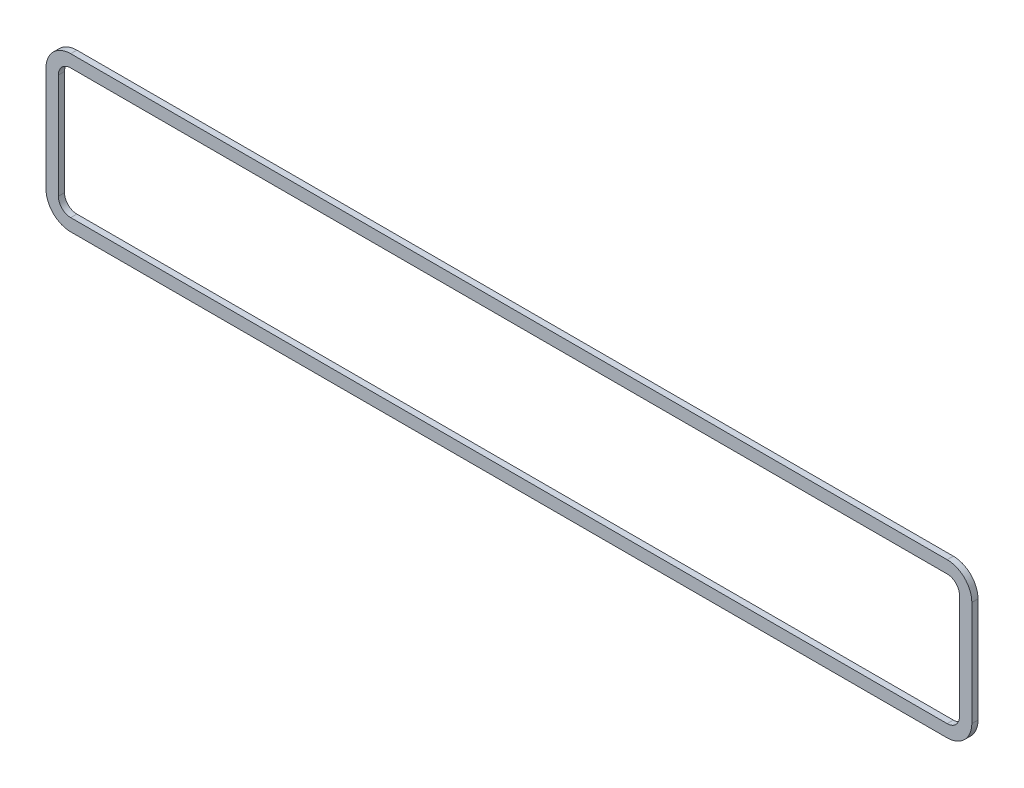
ISO-10303-21;
HEADER;
FILE_DESCRIPTION(('STEP AP214'),'2;1');
FILE_NAME('part.step','',(''),(''),'','','');
FILE_SCHEMA(('AUTOMOTIVE_DESIGN { 1 0 10303 214 1 1 1 1 }'));
ENDSEC;
DATA;
#1=APPLICATION_CONTEXT('core data for automotive mechanical design processes');
#2=APPLICATION_PROTOCOL_DEFINITION('international standard','automotive_design',2000,#1);
#3=PRODUCT_CONTEXT('',#1,'mechanical');
#4=PRODUCT('Part','Part','',(#3));
#5=PRODUCT_RELATED_PRODUCT_CATEGORY('part','',(#4));
#6=PRODUCT_DEFINITION_FORMATION('','',#4);
#7=PRODUCT_DEFINITION_CONTEXT('part definition',#1,'design');
#8=PRODUCT_DEFINITION('design','',#6,#7);
#9=PRODUCT_DEFINITION_SHAPE('','',#8);
#10=(LENGTH_UNIT() NAMED_UNIT(*) SI_UNIT(.MILLI.,.METRE.));
#11=(NAMED_UNIT(*) PLANE_ANGLE_UNIT() SI_UNIT($,.RADIAN.));
#12=(NAMED_UNIT(*) SI_UNIT($,.STERADIAN.) SOLID_ANGLE_UNIT());
#13=UNCERTAINTY_MEASURE_WITH_UNIT(LENGTH_MEASURE(1.E-05),#10,'distance_accuracy_value','');
#14=(GEOMETRIC_REPRESENTATION_CONTEXT(3) GLOBAL_UNCERTAINTY_ASSIGNED_CONTEXT((#13)) GLOBAL_UNIT_ASSIGNED_CONTEXT((#10,
#11,#12)) REPRESENTATION_CONTEXT('',''));
#15=CARTESIAN_POINT('',(0.,0.,0.));
#16=DIRECTION('',(0.,0.,1.));
#17=DIRECTION('',(1.,0.,0.));
#18=AXIS2_PLACEMENT_3D('',#15,#16,#17);
#19=CARTESIAN_POINT('',(35.5,-8.,-0.5));
#20=DIRECTION('',(0.,0.,1.));
#21=DIRECTION('',(1.,0.,0.));
#22=AXIS2_PLACEMENT_3D('',#19,#20,#21);
#23=CYLINDRICAL_SURFACE('',#22,2.);
#24=CARTESIAN_POINT('',(35.5,-8.,0.));
#25=DIRECTION('',(0.,0.,1.));
#26=DIRECTION('',(-1.,0.,0.));
#27=AXIS2_PLACEMENT_3D('',#24,#25,#26);
#28=CIRCLE('',#27,2.);
#29=CARTESIAN_POINT('',(35.5,-10.,0.));
#30=VERTEX_POINT('',#29);
#31=CARTESIAN_POINT('',(37.5,-8.,0.));
#32=VERTEX_POINT('',#31);
#33=EDGE_CURVE('E202',#30,#32,#28,.T.);
#34=ORIENTED_EDGE('',*,*,#33,.F.);
#35=DIRECTION('',(0.,0.,1.));
#36=VECTOR('',#35,1.);
#37=CARTESIAN_POINT('',(35.5,-10.,-0.5));
#38=LINE('',#37,#36);
#39=CARTESIAN_POINT('',(35.5,-10.,-0.5));
#40=VERTEX_POINT('',#39);
#41=EDGE_CURVE('E11',#40,#30,#38,.T.);
#42=ORIENTED_EDGE('',*,*,#41,.F.);
#43=CARTESIAN_POINT('',(35.5,-8.,-0.5));
#44=DIRECTION('',(0.,0.,1.));
#45=DIRECTION('',(-1.,0.,0.));
#46=AXIS2_PLACEMENT_3D('',#43,#44,#45);
#47=CIRCLE('',#46,2.);
#48=CARTESIAN_POINT('',(37.5,-8.,-0.5));
#49=VERTEX_POINT('',#48);
#50=EDGE_CURVE('E214',#40,#49,#47,.T.);
#51=ORIENTED_EDGE('',*,*,#50,.T.);
#52=DIRECTION('',(0.,0.,1.));
#53=VECTOR('',#52,1.);
#54=CARTESIAN_POINT('',(37.5,-8.,-0.5));
#55=LINE('',#54,#53);
#56=EDGE_CURVE('E35',#49,#32,#55,.T.);
#57=ORIENTED_EDGE('',*,*,#56,.T.);
#58=EDGE_LOOP('',(#34,#42,#51,#57));
#59=FACE_BOUND('',#58,.T.);
#60=ADVANCED_FACE('F32',(#59),#23,.T.);
#61=CARTESIAN_POINT('',(-35.5,-10.,-0.5));
#62=DIRECTION('',(0.,-1.,0.));
#63=DIRECTION('',(1.,0.,0.));
#64=AXIS2_PLACEMENT_3D('',#61,#62,#63);
#65=PLANE('',#64);
#66=DIRECTION('',(1.,0.,0.));
#67=VECTOR('',#66,1.);
#68=CARTESIAN_POINT('',(-35.5,-10.,0.));
#69=LINE('',#68,#67);
#70=CARTESIAN_POINT('',(-35.5,-10.,0.));
#71=VERTEX_POINT('',#70);
#72=EDGE_CURVE('E218',#71,#30,#69,.T.);
#73=ORIENTED_EDGE('',*,*,#72,.F.);
#74=DIRECTION('',(0.,0.,1.));
#75=VECTOR('',#74,1.);
#76=CARTESIAN_POINT('',(-35.5,-10.,-0.5));
#77=LINE('',#76,#75);
#78=CARTESIAN_POINT('',(-35.5,-10.,-0.5));
#79=VERTEX_POINT('',#78);
#80=EDGE_CURVE('E40',#79,#71,#77,.T.);
#81=ORIENTED_EDGE('',*,*,#80,.F.);
#82=DIRECTION('',(1.,0.,0.));
#83=VECTOR('',#82,1.);
#84=CARTESIAN_POINT('',(-35.5,-10.,-0.5));
#85=LINE('',#84,#83);
#86=EDGE_CURVE('E236',#79,#40,#85,.T.);
#87=ORIENTED_EDGE('',*,*,#86,.T.);
#88=ORIENTED_EDGE('',*,*,#41,.T.);
#89=EDGE_LOOP('',(#73,#81,#87,#88));
#90=FACE_BOUND('',#89,.T.);
#91=ADVANCED_FACE('F283',(#90),#65,.T.);
#92=CARTESIAN_POINT('',(-35.5,-8.,-0.5));
#93=DIRECTION('',(0.,0.,1.));
#94=DIRECTION('',(1.,0.,0.));
#95=AXIS2_PLACEMENT_3D('',#92,#93,#94);
#96=CYLINDRICAL_SURFACE('',#95,2.);
#97=CARTESIAN_POINT('',(-35.5,-8.,0.));
#98=DIRECTION('',(0.,0.,1.));
#99=DIRECTION('',(1.,0.,0.));
#100=AXIS2_PLACEMENT_3D('',#97,#98,#99);
#101=CIRCLE('',#100,2.);
#102=CARTESIAN_POINT('',(-37.5,-8.,0.));
#103=VERTEX_POINT('',#102);
#104=EDGE_CURVE('E256',#103,#71,#101,.T.);
#105=ORIENTED_EDGE('',*,*,#104,.F.);
#106=DIRECTION('',(0.,0.,1.));
#107=VECTOR('',#106,1.);
#108=CARTESIAN_POINT('',(-37.5,-8.,-0.5));
#109=LINE('',#108,#107);
#110=CARTESIAN_POINT('',(-37.5,-8.,-0.5));
#111=VERTEX_POINT('',#110);
#112=EDGE_CURVE('E262',#111,#103,#109,.T.);
#113=ORIENTED_EDGE('',*,*,#112,.F.);
#114=CARTESIAN_POINT('',(-35.5,-8.,-0.5));
#115=DIRECTION('',(0.,0.,1.));
#116=DIRECTION('',(1.,0.,0.));
#117=AXIS2_PLACEMENT_3D('',#114,#115,#116);
#118=CIRCLE('',#117,2.);
#119=EDGE_CURVE('E233',#111,#79,#118,.T.);
#120=ORIENTED_EDGE('',*,*,#119,.T.);
#121=ORIENTED_EDGE('',*,*,#80,.T.);
#122=EDGE_LOOP('',(#105,#113,#120,#121));
#123=FACE_BOUND('',#122,.T.);
#124=ADVANCED_FACE('F302',(#123),#96,.T.);
#125=CARTESIAN_POINT('',(-37.5,0.500000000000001,-0.5));
#126=DIRECTION('',(-1.,0.,0.));
#127=DIRECTION('',(0.,0.,1.));
#128=AXIS2_PLACEMENT_3D('',#125,#126,#127);
#129=PLANE('',#128);
#130=DIRECTION('',(0.,-1.,0.));
#131=VECTOR('',#130,1.);
#132=CARTESIAN_POINT('',(-37.5,0.500000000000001,0.));
#133=LINE('',#132,#131);
#134=CARTESIAN_POINT('',(-37.5,0.500000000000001,0.));
#135=VERTEX_POINT('',#134);
#136=EDGE_CURVE('E253',#135,#103,#133,.T.);
#137=ORIENTED_EDGE('',*,*,#136,.F.);
#138=DIRECTION('',(0.,0.,1.));
#139=VECTOR('',#138,1.);
#140=CARTESIAN_POINT('',(-37.5,0.500000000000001,-0.5));
#141=LINE('',#140,#139);
#142=CARTESIAN_POINT('',(-37.5,0.500000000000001,-0.5));
#143=VERTEX_POINT('',#142);
#144=EDGE_CURVE('E264',#143,#135,#141,.T.);
#145=ORIENTED_EDGE('',*,*,#144,.F.);
#146=DIRECTION('',(0.,-1.,0.));
#147=VECTOR('',#146,1.);
#148=CARTESIAN_POINT('',(-37.5,0.500000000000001,-0.5));
#149=LINE('',#148,#147);
#150=EDGE_CURVE('E230',#143,#111,#149,.T.);
#151=ORIENTED_EDGE('',*,*,#150,.T.);
#152=ORIENTED_EDGE('',*,*,#112,.T.);
#153=EDGE_LOOP('',(#137,#145,#151,#152));
#154=FACE_BOUND('',#153,.T.);
#155=ADVANCED_FACE('F300',(#154),#129,.T.);
#156=CARTESIAN_POINT('',(-35.5,0.500000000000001,-0.5));
#157=DIRECTION('',(0.,0.,1.));
#158=DIRECTION('',(1.,0.,0.));
#159=AXIS2_PLACEMENT_3D('',#156,#157,#158);
#160=CYLINDRICAL_SURFACE('',#159,2.);
#161=CARTESIAN_POINT('',(-35.5,0.500000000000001,0.));
#162=DIRECTION('',(0.,0.,1.));
#163=DIRECTION('',(-1.,0.,0.));
#164=AXIS2_PLACEMENT_3D('',#161,#162,#163);
#165=CIRCLE('',#164,2.);
#166=CARTESIAN_POINT('',(-35.5,2.5,0.));
#167=VERTEX_POINT('',#166);
#168=EDGE_CURVE('E250',#167,#135,#165,.T.);
#169=ORIENTED_EDGE('',*,*,#168,.F.);
#170=DIRECTION('',(0.,0.,1.));
#171=VECTOR('',#170,1.);
#172=CARTESIAN_POINT('',(-35.5,2.5,-0.5));
#173=LINE('',#172,#171);
#174=CARTESIAN_POINT('',(-35.5,2.5,-0.5));
#175=VERTEX_POINT('',#174);
#176=EDGE_CURVE('E266',#175,#167,#173,.T.);
#177=ORIENTED_EDGE('',*,*,#176,.F.);
#178=CARTESIAN_POINT('',(-35.5,0.500000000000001,-0.5));
#179=DIRECTION('',(0.,0.,1.));
#180=DIRECTION('',(-1.,0.,0.));
#181=AXIS2_PLACEMENT_3D('',#178,#179,#180);
#182=CIRCLE('',#181,2.);
#183=EDGE_CURVE('E227',#175,#143,#182,.T.);
#184=ORIENTED_EDGE('',*,*,#183,.T.);
#185=ORIENTED_EDGE('',*,*,#144,.T.);
#186=EDGE_LOOP('',(#169,#177,#184,#185));
#187=FACE_BOUND('',#186,.T.);
#188=ADVANCED_FACE('F296',(#187),#160,.T.);
#189=CARTESIAN_POINT('',(-35.5,2.5,-0.5));
#190=DIRECTION('',(0.,1.,0.));
#191=DIRECTION('',(0.,0.,1.));
#192=AXIS2_PLACEMENT_3D('',#189,#190,#191);
#193=PLANE('',#192);
#194=DIRECTION('',(-1.,0.,0.));
#195=VECTOR('',#194,1.);
#196=CARTESIAN_POINT('',(-35.5,2.5,0.));
#197=LINE('',#196,#195);
#198=CARTESIAN_POINT('',(35.5,2.5,0.));
#199=VERTEX_POINT('',#198);
#200=EDGE_CURVE('E247',#199,#167,#197,.T.);
#201=ORIENTED_EDGE('',*,*,#200,.F.);
#202=DIRECTION('',(0.,0.,1.));
#203=VECTOR('',#202,1.);
#204=CARTESIAN_POINT('',(35.5,2.5,-0.5));
#205=LINE('',#204,#203);
#206=CARTESIAN_POINT('',(35.5,2.5,-0.5));
#207=VERTEX_POINT('',#206);
#208=EDGE_CURVE('E268',#207,#199,#205,.T.);
#209=ORIENTED_EDGE('',*,*,#208,.F.);
#210=DIRECTION('',(-1.,0.,0.));
#211=VECTOR('',#210,1.);
#212=CARTESIAN_POINT('',(-35.5,2.5,-0.5));
#213=LINE('',#212,#211);
#214=EDGE_CURVE('E224',#207,#175,#213,.T.);
#215=ORIENTED_EDGE('',*,*,#214,.T.);
#216=ORIENTED_EDGE('',*,*,#176,.T.);
#217=EDGE_LOOP('',(#201,#209,#215,#216));
#218=FACE_BOUND('',#217,.T.);
#219=ADVANCED_FACE('F294',(#218),#193,.T.);
#220=CARTESIAN_POINT('',(35.5,0.5,-0.5));
#221=DIRECTION('',(0.,0.,1.));
#222=DIRECTION('',(1.,0.,0.));
#223=AXIS2_PLACEMENT_3D('',#220,#221,#222);
#224=CYLINDRICAL_SURFACE('',#223,2.);
#225=CARTESIAN_POINT('',(35.5,0.5,0.));
#226=DIRECTION('',(0.,0.,1.));
#227=DIRECTION('',(-1.,0.,0.));
#228=AXIS2_PLACEMENT_3D('',#225,#226,#227);
#229=CIRCLE('',#228,2.);
#230=CARTESIAN_POINT('',(37.5,0.500000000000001,0.));
#231=VERTEX_POINT('',#230);
#232=EDGE_CURVE('E244',#231,#199,#229,.T.);
#233=ORIENTED_EDGE('',*,*,#232,.F.);
#234=DIRECTION('',(0.,0.,1.));
#235=VECTOR('',#234,1.);
#236=CARTESIAN_POINT('',(37.5,0.500000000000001,-0.5));
#237=LINE('',#236,#235);
#238=CARTESIAN_POINT('',(37.5,0.500000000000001,-0.5));
#239=VERTEX_POINT('',#238);
#240=EDGE_CURVE('E269',#239,#231,#237,.T.);
#241=ORIENTED_EDGE('',*,*,#240,.F.);
#242=CARTESIAN_POINT('',(35.5,0.5,-0.5));
#243=DIRECTION('',(0.,0.,1.));
#244=DIRECTION('',(-1.,0.,0.));
#245=AXIS2_PLACEMENT_3D('',#242,#243,#244);
#246=CIRCLE('',#245,2.);
#247=EDGE_CURVE('E221',#239,#207,#246,.T.);
#248=ORIENTED_EDGE('',*,*,#247,.T.);
#249=ORIENTED_EDGE('',*,*,#208,.T.);
#250=EDGE_LOOP('',(#233,#241,#248,#249));
#251=FACE_BOUND('',#250,.T.);
#252=ADVANCED_FACE('F290',(#251),#224,.T.);
#253=CARTESIAN_POINT('',(37.5,0.5,-0.5));
#254=DIRECTION('',(1.,0.,0.));
#255=DIRECTION('',(0.,1.,0.));
#256=AXIS2_PLACEMENT_3D('',#253,#254,#255);
#257=PLANE('',#256);
#258=DIRECTION('',(0.,1.,0.));
#259=VECTOR('',#258,1.);
#260=CARTESIAN_POINT('',(37.5,0.5,0.));
#261=LINE('',#260,#259);
#262=EDGE_CURVE('E241',#32,#231,#261,.T.);
#263=ORIENTED_EDGE('',*,*,#262,.F.);
#264=ORIENTED_EDGE('',*,*,#56,.F.);
#265=DIRECTION('',(0.,1.,0.));
#266=VECTOR('',#265,1.);
#267=CARTESIAN_POINT('',(37.5,0.5,-0.5));
#268=LINE('',#267,#266);
#269=EDGE_CURVE('E217',#49,#239,#268,.T.);
#270=ORIENTED_EDGE('',*,*,#269,.T.);
#271=ORIENTED_EDGE('',*,*,#240,.T.);
#272=EDGE_LOOP('',(#263,#264,#270,#271));
#273=FACE_BOUND('',#272,.T.);
#274=ADVANCED_FACE('F277',(#273),#257,.T.);
#275=CARTESIAN_POINT('',(35.5,-8.,-0.5));
#276=DIRECTION('',(0.,0.,-1.));
#277=DIRECTION('',(-1.,0.,0.));
#278=AXIS2_PLACEMENT_3D('',#275,#276,#277);
#279=PLANE('',#278);
#280=CARTESIAN_POINT('',(-35.5,0.500000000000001,-0.5));
#281=DIRECTION('',(0.,0.,1.));
#282=DIRECTION('',(-1.,0.,0.));
#283=AXIS2_PLACEMENT_3D('',#280,#281,#282);
#284=CIRCLE('',#283,1.);
#285=CARTESIAN_POINT('',(-35.5,1.5,-0.5));
#286=VERTEX_POINT('',#285);
#287=CARTESIAN_POINT('',(-36.5,0.500000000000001,-0.5));
#288=VERTEX_POINT('',#287);
#289=EDGE_CURVE('E147',#286,#288,#284,.T.);
#290=ORIENTED_EDGE('',*,*,#289,.T.);
#291=DIRECTION('',(0.,-1.,0.));
#292=VECTOR('',#291,1.);
#293=CARTESIAN_POINT('',(-36.5,0.500000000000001,-0.5));
#294=LINE('',#293,#292);
#295=CARTESIAN_POINT('',(-36.5,-8.,-0.5));
#296=VERTEX_POINT('',#295);
#297=EDGE_CURVE('E156',#288,#296,#294,.T.);
#298=ORIENTED_EDGE('',*,*,#297,.T.);
#299=CARTESIAN_POINT('',(-35.5,-8.,-0.5));
#300=DIRECTION('',(0.,0.,1.));
#301=DIRECTION('',(1.,0.,0.));
#302=AXIS2_PLACEMENT_3D('',#299,#300,#301);
#303=CIRCLE('',#302,1.);
#304=CARTESIAN_POINT('',(-35.5,-9.,-0.5));
#305=VERTEX_POINT('',#304);
#306=EDGE_CURVE('E48',#296,#305,#303,.T.);
#307=ORIENTED_EDGE('',*,*,#306,.T.);
#308=DIRECTION('',(1.,0.,0.));
#309=VECTOR('',#308,1.);
#310=CARTESIAN_POINT('',(-35.5,-9.,-0.5));
#311=LINE('',#310,#309);
#312=CARTESIAN_POINT('',(35.5,-9.,-0.5));
#313=VERTEX_POINT('',#312);
#314=EDGE_CURVE('E171',#305,#313,#311,.T.);
#315=ORIENTED_EDGE('',*,*,#314,.T.);
#316=CARTESIAN_POINT('',(35.5,-8.,-0.5));
#317=DIRECTION('',(0.,0.,1.));
#318=DIRECTION('',(-1.,0.,0.));
#319=AXIS2_PLACEMENT_3D('',#316,#317,#318);
#320=CIRCLE('',#319,0.999999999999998);
#321=CARTESIAN_POINT('',(36.5,-8.,-0.5));
#322=VERTEX_POINT('',#321);
#323=EDGE_CURVE('E174',#313,#322,#320,.T.);
#324=ORIENTED_EDGE('',*,*,#323,.T.);
#325=DIRECTION('',(0.,1.,0.));
#326=VECTOR('',#325,1.);
#327=CARTESIAN_POINT('',(36.5,0.5,-0.5));
#328=LINE('',#327,#326);
#329=CARTESIAN_POINT('',(36.5,0.500000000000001,-0.5));
#330=VERTEX_POINT('',#329);
#331=EDGE_CURVE('E177',#322,#330,#328,.T.);
#332=ORIENTED_EDGE('',*,*,#331,.T.);
#333=CARTESIAN_POINT('',(35.5,0.5,-0.5));
#334=DIRECTION('',(0.,0.,1.));
#335=DIRECTION('',(-1.,0.,0.));
#336=AXIS2_PLACEMENT_3D('',#333,#334,#335);
#337=CIRCLE('',#336,1.);
#338=CARTESIAN_POINT('',(35.5,1.5,-0.5));
#339=VERTEX_POINT('',#338);
#340=EDGE_CURVE('E180',#330,#339,#337,.T.);
#341=ORIENTED_EDGE('',*,*,#340,.T.);
#342=DIRECTION('',(-1.,0.,0.));
#343=VECTOR('',#342,1.);
#344=CARTESIAN_POINT('',(-35.5,1.5,-0.5));
#345=LINE('',#344,#343);
#346=EDGE_CURVE('E153',#339,#286,#345,.T.);
#347=ORIENTED_EDGE('',*,*,#346,.T.);
#348=EDGE_LOOP('',(#290,#298,#307,#315,#324,#332,#341,#347));
#349=FACE_BOUND('',#348,.T.);
#350=ORIENTED_EDGE('',*,*,#50,.F.);
#351=ORIENTED_EDGE('',*,*,#86,.F.);
#352=ORIENTED_EDGE('',*,*,#119,.F.);
#353=ORIENTED_EDGE('',*,*,#150,.F.);
#354=ORIENTED_EDGE('',*,*,#183,.F.);
#355=ORIENTED_EDGE('',*,*,#214,.F.);
#356=ORIENTED_EDGE('',*,*,#247,.F.);
#357=ORIENTED_EDGE('',*,*,#269,.F.);
#358=EDGE_LOOP('',(#350,#351,#352,#353,#354,#355,#356,#357));
#359=FACE_BOUND('',#358,.T.);
#360=ADVANCED_FACE('F160',(#349,#359),#279,.T.);
#361=CARTESIAN_POINT('',(35.5,-8.,0.));
#362=DIRECTION('',(0.,0.,-1.));
#363=DIRECTION('',(-1.,0.,0.));
#364=AXIS2_PLACEMENT_3D('',#361,#362,#363);
#365=PLANE('',#364);
#366=DIRECTION('',(0.,-1.,0.));
#367=VECTOR('',#366,1.);
#368=CARTESIAN_POINT('',(-36.5,0.500000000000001,0.));
#369=LINE('',#368,#367);
#370=CARTESIAN_POINT('',(-36.5,0.500000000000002,0.));
#371=VERTEX_POINT('',#370);
#372=CARTESIAN_POINT('',(-36.5,-8.,0.));
#373=VERTEX_POINT('',#372);
#374=EDGE_CURVE('E184',#371,#373,#369,.T.);
#375=ORIENTED_EDGE('',*,*,#374,.F.);
#376=CARTESIAN_POINT('',(-35.5,0.500000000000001,0.));
#377=DIRECTION('',(0.,0.,1.));
#378=DIRECTION('',(-1.,0.,0.));
#379=AXIS2_PLACEMENT_3D('',#376,#377,#378);
#380=CIRCLE('',#379,1.);
#381=CARTESIAN_POINT('',(-35.5,1.5,0.));
#382=VERTEX_POINT('',#381);
#383=EDGE_CURVE('E56',#382,#371,#380,.T.);
#384=ORIENTED_EDGE('',*,*,#383,.F.);
#385=DIRECTION('',(-1.,0.,0.));
#386=VECTOR('',#385,1.);
#387=CARTESIAN_POINT('',(-35.5,1.5,0.));
#388=LINE('',#387,#386);
#389=CARTESIAN_POINT('',(35.5,1.5,0.));
#390=VERTEX_POINT('',#389);
#391=EDGE_CURVE('E164',#390,#382,#388,.T.);
#392=ORIENTED_EDGE('',*,*,#391,.F.);
#393=CARTESIAN_POINT('',(35.5,0.5,0.));
#394=DIRECTION('',(0.,0.,1.));
#395=DIRECTION('',(-1.,0.,0.));
#396=AXIS2_PLACEMENT_3D('',#393,#394,#395);
#397=CIRCLE('',#396,1.);
#398=CARTESIAN_POINT('',(36.5,0.500000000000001,0.));
#399=VERTEX_POINT('',#398);
#400=EDGE_CURVE('E167',#399,#390,#397,.T.);
#401=ORIENTED_EDGE('',*,*,#400,.F.);
#402=DIRECTION('',(0.,1.,0.));
#403=VECTOR('',#402,1.);
#404=CARTESIAN_POINT('',(36.5,0.5,0.));
#405=LINE('',#404,#403);
#406=CARTESIAN_POINT('',(36.5,-8.,0.));
#407=VERTEX_POINT('',#406);
#408=EDGE_CURVE('E195',#407,#399,#405,.T.);
#409=ORIENTED_EDGE('',*,*,#408,.F.);
#410=CARTESIAN_POINT('',(35.5,-8.,0.));
#411=DIRECTION('',(0.,0.,1.));
#412=DIRECTION('',(-1.,0.,0.));
#413=AXIS2_PLACEMENT_3D('',#410,#411,#412);
#414=CIRCLE('',#413,0.999999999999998);
#415=CARTESIAN_POINT('',(35.5,-9.,0.));
#416=VERTEX_POINT('',#415);
#417=EDGE_CURVE('E192',#416,#407,#414,.T.);
#418=ORIENTED_EDGE('',*,*,#417,.F.);
#419=DIRECTION('',(1.,0.,0.));
#420=VECTOR('',#419,1.);
#421=CARTESIAN_POINT('',(-35.5,-9.,0.));
#422=LINE('',#421,#420);
#423=CARTESIAN_POINT('',(-35.5,-9.,0.));
#424=VERTEX_POINT('',#423);
#425=EDGE_CURVE('E189',#424,#416,#422,.T.);
#426=ORIENTED_EDGE('',*,*,#425,.F.);
#427=CARTESIAN_POINT('',(-35.5,-8.,0.));
#428=DIRECTION('',(0.,0.,1.));
#429=DIRECTION('',(1.,0.,0.));
#430=AXIS2_PLACEMENT_3D('',#427,#428,#429);
#431=CIRCLE('',#430,1.);
#432=EDGE_CURVE('E186',#373,#424,#431,.T.);
#433=ORIENTED_EDGE('',*,*,#432,.F.);
#434=EDGE_LOOP('',(#375,#384,#392,#401,#409,#418,#426,#433));
#435=FACE_BOUND('',#434,.T.);
#436=ORIENTED_EDGE('',*,*,#33,.T.);
#437=ORIENTED_EDGE('',*,*,#262,.T.);
#438=ORIENTED_EDGE('',*,*,#232,.T.);
#439=ORIENTED_EDGE('',*,*,#200,.T.);
#440=ORIENTED_EDGE('',*,*,#168,.T.);
#441=ORIENTED_EDGE('',*,*,#136,.T.);
#442=ORIENTED_EDGE('',*,*,#104,.T.);
#443=ORIENTED_EDGE('',*,*,#72,.T.);
#444=EDGE_LOOP('',(#436,#437,#438,#439,#440,#441,#442,#443));
#445=FACE_BOUND('',#444,.T.);
#446=ADVANCED_FACE('F279',(#435,#445),#365,.F.);
#447=CARTESIAN_POINT('',(-35.5,0.500000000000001,-0.5));
#448=DIRECTION('',(0.,0.,1.));
#449=DIRECTION('',(1.,0.,0.));
#450=AXIS2_PLACEMENT_3D('',#447,#448,#449);
#451=CYLINDRICAL_SURFACE('',#450,1.);
#452=ORIENTED_EDGE('',*,*,#383,.T.);
#453=DIRECTION('',(0.,0.,1.));
#454=VECTOR('',#453,1.);
#455=CARTESIAN_POINT('',(-36.5,0.500000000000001,-0.5));
#456=LINE('',#455,#454);
#457=EDGE_CURVE('E143',#288,#371,#456,.T.);
#458=ORIENTED_EDGE('',*,*,#457,.F.);
#459=ORIENTED_EDGE('',*,*,#289,.F.);
#460=DIRECTION('',(0.,0.,1.));
#461=VECTOR('',#460,1.);
#462=CARTESIAN_POINT('',(-35.5,1.5,-0.5));
#463=LINE('',#462,#461);
#464=EDGE_CURVE('E200',#286,#382,#463,.T.);
#465=ORIENTED_EDGE('',*,*,#464,.T.);
#466=EDGE_LOOP('',(#452,#458,#459,#465));
#467=FACE_BOUND('',#466,.T.);
#468=ADVANCED_FACE('F145',(#467),#451,.F.);
#469=CARTESIAN_POINT('',(-35.5,1.5,-0.5));
#470=DIRECTION('',(0.,1.,0.));
#471=DIRECTION('',(0.,0.,1.));
#472=AXIS2_PLACEMENT_3D('',#469,#470,#471);
#473=PLANE('',#472);
#474=ORIENTED_EDGE('',*,*,#391,.T.);
#475=ORIENTED_EDGE('',*,*,#464,.F.);
#476=ORIENTED_EDGE('',*,*,#346,.F.);
#477=DIRECTION('',(0.,0.,1.));
#478=VECTOR('',#477,1.);
#479=CARTESIAN_POINT('',(35.5,1.5,-0.5));
#480=LINE('',#479,#478);
#481=EDGE_CURVE('E203',#339,#390,#480,.T.);
#482=ORIENTED_EDGE('',*,*,#481,.T.);
#483=EDGE_LOOP('',(#474,#475,#476,#482));
#484=FACE_BOUND('',#483,.T.);
#485=ADVANCED_FACE('F385',(#484),#473,.F.);
#486=CARTESIAN_POINT('',(35.5,0.5,-0.5));
#487=DIRECTION('',(0.,0.,1.));
#488=DIRECTION('',(1.,0.,0.));
#489=AXIS2_PLACEMENT_3D('',#486,#487,#488);
#490=CYLINDRICAL_SURFACE('',#489,1.);
#491=ORIENTED_EDGE('',*,*,#400,.T.);
#492=ORIENTED_EDGE('',*,*,#481,.F.);
#493=ORIENTED_EDGE('',*,*,#340,.F.);
#494=DIRECTION('',(0.,0.,1.));
#495=VECTOR('',#494,1.);
#496=CARTESIAN_POINT('',(36.5,0.500000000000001,-0.5));
#497=LINE('',#496,#495);
#498=EDGE_CURVE('E205',#330,#399,#497,.T.);
#499=ORIENTED_EDGE('',*,*,#498,.T.);
#500=EDGE_LOOP('',(#491,#492,#493,#499));
#501=FACE_BOUND('',#500,.T.);
#502=ADVANCED_FACE('F394',(#501),#490,.F.);
#503=CARTESIAN_POINT('',(36.5,0.5,-0.5));
#504=DIRECTION('',(1.,0.,0.));
#505=DIRECTION('',(0.,0.,-1.));
#506=AXIS2_PLACEMENT_3D('',#503,#504,#505);
#507=PLANE('',#506);
#508=ORIENTED_EDGE('',*,*,#408,.T.);
#509=ORIENTED_EDGE('',*,*,#498,.F.);
#510=ORIENTED_EDGE('',*,*,#331,.F.);
#511=DIRECTION('',(0.,0.,1.));
#512=VECTOR('',#511,1.);
#513=CARTESIAN_POINT('',(36.5,-8.,-0.5));
#514=LINE('',#513,#512);
#515=EDGE_CURVE('E207',#322,#407,#514,.T.);
#516=ORIENTED_EDGE('',*,*,#515,.T.);
#517=EDGE_LOOP('',(#508,#509,#510,#516));
#518=FACE_BOUND('',#517,.T.);
#519=ADVANCED_FACE('F404',(#518),#507,.F.);
#520=CARTESIAN_POINT('',(35.5,-8.,-0.5));
#521=DIRECTION('',(0.,0.,1.));
#522=DIRECTION('',(1.,0.,0.));
#523=AXIS2_PLACEMENT_3D('',#520,#521,#522);
#524=CYLINDRICAL_SURFACE('',#523,0.999999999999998);
#525=ORIENTED_EDGE('',*,*,#417,.T.);
#526=ORIENTED_EDGE('',*,*,#515,.F.);
#527=ORIENTED_EDGE('',*,*,#323,.F.);
#528=DIRECTION('',(0.,0.,1.));
#529=VECTOR('',#528,1.);
#530=CARTESIAN_POINT('',(35.5,-9.,-0.5));
#531=LINE('',#530,#529);
#532=EDGE_CURVE('E209',#313,#416,#531,.T.);
#533=ORIENTED_EDGE('',*,*,#532,.T.);
#534=EDGE_LOOP('',(#525,#526,#527,#533));
#535=FACE_BOUND('',#534,.T.);
#536=ADVANCED_FACE('F414',(#535),#524,.F.);
#537=CARTESIAN_POINT('',(-35.5,-9.,-0.5));
#538=DIRECTION('',(0.,-1.,0.));
#539=DIRECTION('',(1.,0.,0.));
#540=AXIS2_PLACEMENT_3D('',#537,#538,#539);
#541=PLANE('',#540);
#542=ORIENTED_EDGE('',*,*,#425,.T.);
#543=ORIENTED_EDGE('',*,*,#532,.F.);
#544=ORIENTED_EDGE('',*,*,#314,.F.);
#545=DIRECTION('',(0.,0.,1.));
#546=VECTOR('',#545,1.);
#547=CARTESIAN_POINT('',(-35.5,-9.,-0.5));
#548=LINE('',#547,#546);
#549=EDGE_CURVE('E211',#305,#424,#548,.T.);
#550=ORIENTED_EDGE('',*,*,#549,.T.);
#551=EDGE_LOOP('',(#542,#543,#544,#550));
#552=FACE_BOUND('',#551,.T.);
#553=ADVANCED_FACE('F424',(#552),#541,.F.);
#554=CARTESIAN_POINT('',(-35.5,-8.,-0.5));
#555=DIRECTION('',(0.,0.,1.));
#556=DIRECTION('',(1.,0.,0.));
#557=AXIS2_PLACEMENT_3D('',#554,#555,#556);
#558=CYLINDRICAL_SURFACE('',#557,1.);
#559=ORIENTED_EDGE('',*,*,#432,.T.);
#560=ORIENTED_EDGE('',*,*,#549,.F.);
#561=ORIENTED_EDGE('',*,*,#306,.F.);
#562=DIRECTION('',(0.,0.,1.));
#563=VECTOR('',#562,1.);
#564=CARTESIAN_POINT('',(-36.5,-8.,-0.5));
#565=LINE('',#564,#563);
#566=EDGE_CURVE('E152',#296,#373,#565,.T.);
#567=ORIENTED_EDGE('',*,*,#566,.T.);
#568=EDGE_LOOP('',(#559,#560,#561,#567));
#569=FACE_BOUND('',#568,.T.);
#570=ADVANCED_FACE('F434',(#569),#558,.F.);
#571=CARTESIAN_POINT('',(-36.5,0.500000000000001,-0.5));
#572=DIRECTION('',(-1.,0.,0.));
#573=DIRECTION('',(0.,0.,1.));
#574=AXIS2_PLACEMENT_3D('',#571,#572,#573);
#575=PLANE('',#574);
#576=ORIENTED_EDGE('',*,*,#374,.T.);
#577=ORIENTED_EDGE('',*,*,#566,.F.);
#578=ORIENTED_EDGE('',*,*,#297,.F.);
#579=ORIENTED_EDGE('',*,*,#457,.T.);
#580=EDGE_LOOP('',(#576,#577,#578,#579));
#581=FACE_BOUND('',#580,.T.);
#582=ADVANCED_FACE('F157',(#581),#575,.F.);
#583=CLOSED_SHELL('',(#60,#91,#124,#155,#188,#219,#252,#274,#360,#446,#468,#485,#502,#519,#536,
#553,#570,#582));
#584=MANIFOLD_SOLID_BREP('B2',#583);
#585=ADVANCED_BREP_SHAPE_REPRESENTATION('',(#18,#584),#14);
#586=SHAPE_DEFINITION_REPRESENTATION(#9,#585);
ENDSEC;
END-ISO-10303-21;
